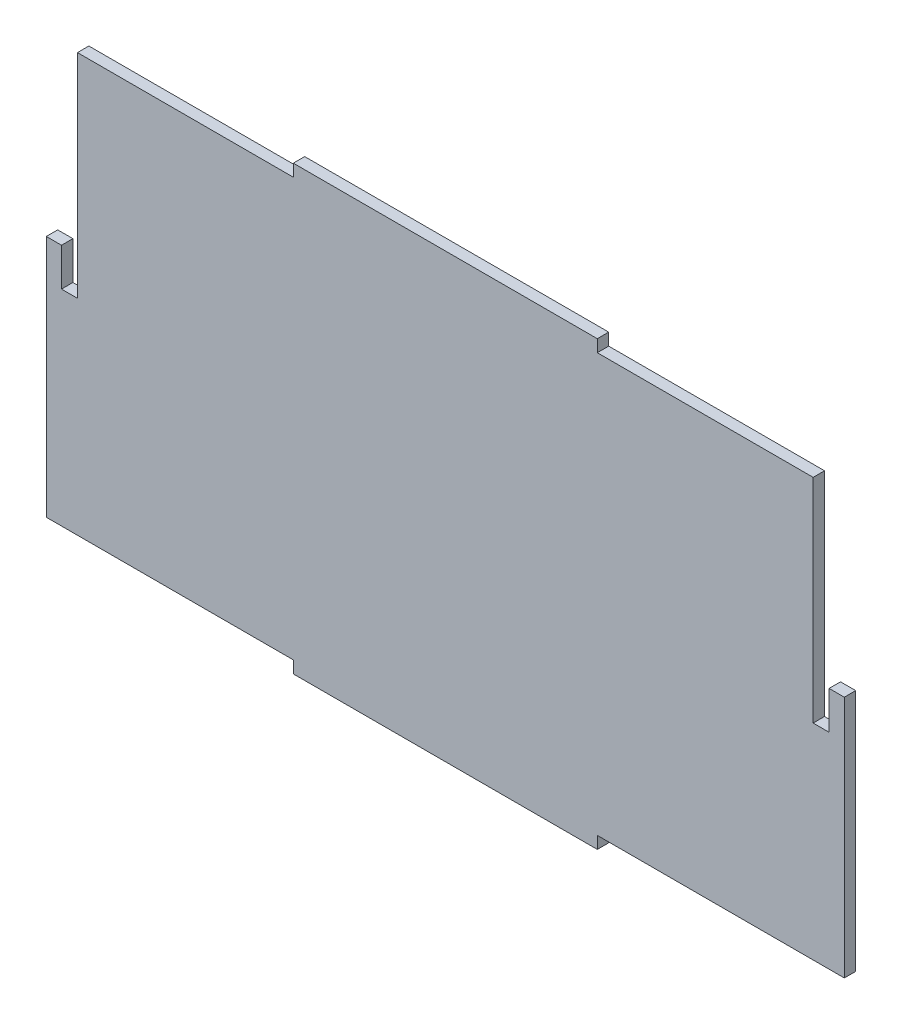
ISO-10303-21;
HEADER;
FILE_DESCRIPTION(('STEP AP214'),'2;1');
FILE_NAME('part.step','',(''),(''),'','','');
FILE_SCHEMA(('AUTOMOTIVE_DESIGN { 1 0 10303 214 1 1 1 1 }'));
ENDSEC;
DATA;
#1=APPLICATION_CONTEXT('core data for automotive mechanical design processes');
#2=APPLICATION_PROTOCOL_DEFINITION('international standard','automotive_design',2000,#1);
#3=PRODUCT_CONTEXT('',#1,'mechanical');
#4=PRODUCT('Part','Part','',(#3));
#5=PRODUCT_RELATED_PRODUCT_CATEGORY('part','',(#4));
#6=PRODUCT_DEFINITION_FORMATION('','',#4);
#7=PRODUCT_DEFINITION_CONTEXT('part definition',#1,'design');
#8=PRODUCT_DEFINITION('design','',#6,#7);
#9=PRODUCT_DEFINITION_SHAPE('','',#8);
#10=(LENGTH_UNIT() NAMED_UNIT(*) SI_UNIT(.MILLI.,.METRE.));
#11=(NAMED_UNIT(*) PLANE_ANGLE_UNIT() SI_UNIT($,.RADIAN.));
#12=(NAMED_UNIT(*) SI_UNIT($,.STERADIAN.) SOLID_ANGLE_UNIT());
#13=UNCERTAINTY_MEASURE_WITH_UNIT(LENGTH_MEASURE(1.E-05),#10,'distance_accuracy_value','');
#14=(GEOMETRIC_REPRESENTATION_CONTEXT(3) GLOBAL_UNCERTAINTY_ASSIGNED_CONTEXT((#13)) GLOBAL_UNIT_ASSIGNED_CONTEXT((#10,
#11,#12)) REPRESENTATION_CONTEXT('',''));
#15=CARTESIAN_POINT('',(0.,0.,0.));
#16=DIRECTION('',(0.,0.,1.));
#17=DIRECTION('',(1.,0.,0.));
#18=AXIS2_PLACEMENT_3D('',#15,#16,#17);
#19=CARTESIAN_POINT('',(-52.5,27.5,1.5));
#20=DIRECTION('',(1.,0.,0.));
#21=DIRECTION('',(0.,0.,-1.));
#22=AXIS2_PLACEMENT_3D('',#19,#20,#21);
#23=PLANE('',#22);
#24=DIRECTION('',(0.,-1.,0.));
#25=VECTOR('',#24,1.);
#26=CARTESIAN_POINT('',(-52.5,27.5,1.5));
#27=LINE('',#26,#25);
#28=CARTESIAN_POINT('',(-52.5,4.5,1.5));
#29=VERTEX_POINT('',#28);
#30=CARTESIAN_POINT('',(-52.5,-27.5,1.5));
#31=VERTEX_POINT('',#30);
#32=EDGE_CURVE('E184',#29,#31,#27,.T.);
#33=ORIENTED_EDGE('',*,*,#32,.F.);
#34=DIRECTION('',(0.,0.,1.));
#35=VECTOR('',#34,1.);
#36=CARTESIAN_POINT('',(-52.5,4.5,-8.5));
#37=LINE('',#36,#35);
#38=CARTESIAN_POINT('',(-52.5,4.5,0.));
#39=VERTEX_POINT('',#38);
#40=EDGE_CURVE('E172',#39,#29,#37,.T.);
#41=ORIENTED_EDGE('',*,*,#40,.F.);
#42=DIRECTION('',(0.,-1.,0.));
#43=VECTOR('',#42,1.);
#44=CARTESIAN_POINT('',(-52.5,27.5,0.));
#45=LINE('',#44,#43);
#46=CARTESIAN_POINT('',(-52.5,-27.5,0.));
#47=VERTEX_POINT('',#46);
#48=EDGE_CURVE('E256',#39,#47,#45,.T.);
#49=ORIENTED_EDGE('',*,*,#48,.T.);
#50=DIRECTION('',(0.,0.,-1.));
#51=VECTOR('',#50,1.);
#52=CARTESIAN_POINT('',(-52.5,-27.5,1.5));
#53=LINE('',#52,#51);
#54=EDGE_CURVE('E192',#31,#47,#53,.T.);
#55=ORIENTED_EDGE('',*,*,#54,.F.);
#56=EDGE_LOOP('',(#33,#41,#49,#55));
#57=FACE_BOUND('',#56,.T.);
#58=ADVANCED_FACE('F38',(#57),#23,.F.);
#59=CARTESIAN_POINT('',(-52.5,-27.5,1.5));
#60=DIRECTION('',(0.,1.,0.));
#61=DIRECTION('',(-1.,0.,0.));
#62=AXIS2_PLACEMENT_3D('',#59,#60,#61);
#63=PLANE('',#62);
#64=DIRECTION('',(1.,0.,0.));
#65=VECTOR('',#64,1.);
#66=CARTESIAN_POINT('',(-52.5,-27.5,0.));
#67=LINE('',#66,#65);
#68=CARTESIAN_POINT('',(-20.,-27.5,0.));
#69=VERTEX_POINT('',#68);
#70=EDGE_CURVE('E259',#47,#69,#67,.T.);
#71=ORIENTED_EDGE('',*,*,#70,.T.);
#72=DIRECTION('',(0.,0.,-1.));
#73=VECTOR('',#72,1.);
#74=CARTESIAN_POINT('',(-20.,-27.5,1.5));
#75=LINE('',#74,#73);
#76=CARTESIAN_POINT('',(-20.,-27.5,1.5));
#77=VERTEX_POINT('',#76);
#78=EDGE_CURVE('E362',#77,#69,#75,.T.);
#79=ORIENTED_EDGE('',*,*,#78,.F.);
#80=DIRECTION('',(1.,0.,0.));
#81=VECTOR('',#80,1.);
#82=CARTESIAN_POINT('',(-52.5,-27.5,1.5));
#83=LINE('',#82,#81);
#84=EDGE_CURVE('E194',#31,#77,#83,.T.);
#85=ORIENTED_EDGE('',*,*,#84,.F.);
#86=ORIENTED_EDGE('',*,*,#54,.T.);
#87=EDGE_LOOP('',(#71,#79,#85,#86));
#88=FACE_BOUND('',#87,.T.);
#89=ADVANCED_FACE('F400',(#88),#63,.F.);
#90=CARTESIAN_POINT('',(-20.,-27.5,1.5));
#91=DIRECTION('',(1.,0.,0.));
#92=DIRECTION('',(0.,0.,-1.));
#93=AXIS2_PLACEMENT_3D('',#90,#91,#92);
#94=PLANE('',#93);
#95=DIRECTION('',(0.,-1.,0.));
#96=VECTOR('',#95,1.);
#97=CARTESIAN_POINT('',(-20.,-27.5,0.));
#98=LINE('',#97,#96);
#99=CARTESIAN_POINT('',(-20.,-29.1,0.));
#100=VERTEX_POINT('',#99);
#101=EDGE_CURVE('E262',#69,#100,#98,.T.);
#102=ORIENTED_EDGE('',*,*,#101,.T.);
#103=DIRECTION('',(0.,0.,-1.));
#104=VECTOR('',#103,1.);
#105=CARTESIAN_POINT('',(-20.,-29.1,1.5));
#106=LINE('',#105,#104);
#107=CARTESIAN_POINT('',(-20.,-29.1,1.5));
#108=VERTEX_POINT('',#107);
#109=EDGE_CURVE('E358',#108,#100,#106,.T.);
#110=ORIENTED_EDGE('',*,*,#109,.F.);
#111=DIRECTION('',(0.,-1.,0.));
#112=VECTOR('',#111,1.);
#113=CARTESIAN_POINT('',(-20.,-27.5,1.5));
#114=LINE('',#113,#112);
#115=EDGE_CURVE('E199',#77,#108,#114,.T.);
#116=ORIENTED_EDGE('',*,*,#115,.F.);
#117=ORIENTED_EDGE('',*,*,#78,.T.);
#118=EDGE_LOOP('',(#102,#110,#116,#117));
#119=FACE_BOUND('',#118,.T.);
#120=ADVANCED_FACE('F396',(#119),#94,.F.);
#121=CARTESIAN_POINT('',(-20.,-29.1,1.5));
#122=DIRECTION('',(0.,1.,0.));
#123=DIRECTION('',(-1.,0.,0.));
#124=AXIS2_PLACEMENT_3D('',#121,#122,#123);
#125=PLANE('',#124);
#126=DIRECTION('',(1.,0.,0.));
#127=VECTOR('',#126,1.);
#128=CARTESIAN_POINT('',(-20.,-29.1,0.));
#129=LINE('',#128,#127);
#130=CARTESIAN_POINT('',(20.,-29.1,0.));
#131=VERTEX_POINT('',#130);
#132=EDGE_CURVE('E265',#100,#131,#129,.T.);
#133=ORIENTED_EDGE('',*,*,#132,.T.);
#134=DIRECTION('',(0.,0.,-1.));
#135=VECTOR('',#134,1.);
#136=CARTESIAN_POINT('',(20.,-29.1,1.5));
#137=LINE('',#136,#135);
#138=CARTESIAN_POINT('',(20.,-29.1,1.5));
#139=VERTEX_POINT('',#138);
#140=EDGE_CURVE('E354',#139,#131,#137,.T.);
#141=ORIENTED_EDGE('',*,*,#140,.F.);
#142=DIRECTION('',(1.,0.,0.));
#143=VECTOR('',#142,1.);
#144=CARTESIAN_POINT('',(-20.,-29.1,1.5));
#145=LINE('',#144,#143);
#146=EDGE_CURVE('E210',#108,#139,#145,.T.);
#147=ORIENTED_EDGE('',*,*,#146,.F.);
#148=ORIENTED_EDGE('',*,*,#109,.T.);
#149=EDGE_LOOP('',(#133,#141,#147,#148));
#150=FACE_BOUND('',#149,.T.);
#151=ADVANCED_FACE('F392',(#150),#125,.F.);
#152=CARTESIAN_POINT('',(20.,-27.5,1.5));
#153=DIRECTION('',(-1.,0.,0.));
#154=DIRECTION('',(0.,0.,1.));
#155=AXIS2_PLACEMENT_3D('',#152,#153,#154);
#156=PLANE('',#155);
#157=DIRECTION('',(0.,1.,0.));
#158=VECTOR('',#157,1.);
#159=CARTESIAN_POINT('',(20.,-27.5,0.));
#160=LINE('',#159,#158);
#161=CARTESIAN_POINT('',(20.,-27.5,0.));
#162=VERTEX_POINT('',#161);
#163=EDGE_CURVE('E268',#131,#162,#160,.T.);
#164=ORIENTED_EDGE('',*,*,#163,.T.);
#165=DIRECTION('',(0.,0.,-1.));
#166=VECTOR('',#165,1.);
#167=CARTESIAN_POINT('',(20.,-27.5,1.5));
#168=LINE('',#167,#166);
#169=CARTESIAN_POINT('',(20.,-27.5,1.5));
#170=VERTEX_POINT('',#169);
#171=EDGE_CURVE('E350',#170,#162,#168,.T.);
#172=ORIENTED_EDGE('',*,*,#171,.F.);
#173=DIRECTION('',(0.,1.,0.));
#174=VECTOR('',#173,1.);
#175=CARTESIAN_POINT('',(20.,-27.5,1.5));
#176=LINE('',#175,#174);
#177=EDGE_CURVE('E213',#139,#170,#176,.T.);
#178=ORIENTED_EDGE('',*,*,#177,.F.);
#179=ORIENTED_EDGE('',*,*,#140,.T.);
#180=EDGE_LOOP('',(#164,#172,#178,#179));
#181=FACE_BOUND('',#180,.T.);
#182=ADVANCED_FACE('F387',(#181),#156,.F.);
#183=CARTESIAN_POINT('',(20.,-27.5,1.5));
#184=DIRECTION('',(0.,1.,0.));
#185=DIRECTION('',(-1.,0.,0.));
#186=AXIS2_PLACEMENT_3D('',#183,#184,#185);
#187=PLANE('',#186);
#188=DIRECTION('',(1.,0.,0.));
#189=VECTOR('',#188,1.);
#190=CARTESIAN_POINT('',(20.,-27.5,0.));
#191=LINE('',#190,#189);
#192=CARTESIAN_POINT('',(52.5,-27.5,0.));
#193=VERTEX_POINT('',#192);
#194=EDGE_CURVE('E271',#162,#193,#191,.T.);
#195=ORIENTED_EDGE('',*,*,#194,.T.);
#196=DIRECTION('',(0.,0.,-1.));
#197=VECTOR('',#196,1.);
#198=CARTESIAN_POINT('',(52.5,-27.5,1.5));
#199=LINE('',#198,#197);
#200=CARTESIAN_POINT('',(52.5,-27.5,1.5));
#201=VERTEX_POINT('',#200);
#202=EDGE_CURVE('E346',#201,#193,#199,.T.);
#203=ORIENTED_EDGE('',*,*,#202,.F.);
#204=DIRECTION('',(1.,0.,0.));
#205=VECTOR('',#204,1.);
#206=CARTESIAN_POINT('',(20.,-27.5,1.5));
#207=LINE('',#206,#205);
#208=EDGE_CURVE('E216',#170,#201,#207,.T.);
#209=ORIENTED_EDGE('',*,*,#208,.F.);
#210=ORIENTED_EDGE('',*,*,#171,.T.);
#211=EDGE_LOOP('',(#195,#203,#209,#210));
#212=FACE_BOUND('',#211,.T.);
#213=ADVANCED_FACE('F381',(#212),#187,.F.);
#214=CARTESIAN_POINT('',(52.5,27.5,1.5));
#215=DIRECTION('',(-1.,0.,0.));
#216=DIRECTION('',(0.,-1.,0.));
#217=AXIS2_PLACEMENT_3D('',#214,#215,#216);
#218=PLANE('',#217);
#219=DIRECTION('',(0.,1.,0.));
#220=VECTOR('',#219,1.);
#221=CARTESIAN_POINT('',(52.5,27.5,0.));
#222=LINE('',#221,#220);
#223=CARTESIAN_POINT('',(52.5,4.5,0.));
#224=VERTEX_POINT('',#223);
#225=EDGE_CURVE('E274',#193,#224,#222,.T.);
#226=ORIENTED_EDGE('',*,*,#225,.T.);
#227=DIRECTION('',(0.,0.,1.));
#228=VECTOR('',#227,1.);
#229=CARTESIAN_POINT('',(52.5,4.5,-8.5));
#230=LINE('',#229,#228);
#231=CARTESIAN_POINT('',(52.5,4.5,1.5));
#232=VERTEX_POINT('',#231);
#233=EDGE_CURVE('E53',#224,#232,#230,.T.);
#234=ORIENTED_EDGE('',*,*,#233,.T.);
#235=DIRECTION('',(0.,1.,0.));
#236=VECTOR('',#235,1.);
#237=CARTESIAN_POINT('',(52.5,27.5,1.5));
#238=LINE('',#237,#236);
#239=EDGE_CURVE('E219',#201,#232,#238,.T.);
#240=ORIENTED_EDGE('',*,*,#239,.F.);
#241=ORIENTED_EDGE('',*,*,#202,.T.);
#242=EDGE_LOOP('',(#226,#234,#240,#241));
#243=FACE_BOUND('',#242,.T.);
#244=ADVANCED_FACE('F376',(#243),#218,.F.);
#245=CARTESIAN_POINT('',(50.5,27.5,1.5));
#246=DIRECTION('',(1.,0.,0.));
#247=DIRECTION('',(0.,0.,-1.));
#248=AXIS2_PLACEMENT_3D('',#245,#246,#247);
#249=PLANE('',#248);
#250=DIRECTION('',(0.,-1.,0.));
#251=VECTOR('',#250,1.);
#252=CARTESIAN_POINT('',(50.5,27.5,1.5));
#253=LINE('',#252,#251);
#254=CARTESIAN_POINT('',(50.5,4.5,1.5));
#255=VERTEX_POINT('',#254);
#256=CARTESIAN_POINT('',(50.5,-0.499999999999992,1.5));
#257=VERTEX_POINT('',#256);
#258=EDGE_CURVE('E223',#255,#257,#253,.T.);
#259=ORIENTED_EDGE('',*,*,#258,.F.);
#260=DIRECTION('',(0.,0.,1.));
#261=VECTOR('',#260,1.);
#262=CARTESIAN_POINT('',(50.5,4.5,-8.5));
#263=LINE('',#262,#261);
#264=CARTESIAN_POINT('',(50.5,4.5,0.));
#265=VERTEX_POINT('',#264);
#266=EDGE_CURVE('E205',#265,#255,#263,.T.);
#267=ORIENTED_EDGE('',*,*,#266,.F.);
#268=DIRECTION('',(0.,-1.,0.));
#269=VECTOR('',#268,1.);
#270=CARTESIAN_POINT('',(50.5,27.5,0.));
#271=LINE('',#270,#269);
#272=CARTESIAN_POINT('',(50.5,-0.499999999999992,0.));
#273=VERTEX_POINT('',#272);
#274=EDGE_CURVE('E278',#265,#273,#271,.T.);
#275=ORIENTED_EDGE('',*,*,#274,.T.);
#276=DIRECTION('',(0.,0.,-1.));
#277=VECTOR('',#276,1.);
#278=CARTESIAN_POINT('',(50.5,-0.499999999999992,1.5));
#279=LINE('',#278,#277);
#280=EDGE_CURVE('E342',#257,#273,#279,.T.);
#281=ORIENTED_EDGE('',*,*,#280,.F.);
#282=EDGE_LOOP('',(#259,#267,#275,#281));
#283=FACE_BOUND('',#282,.T.);
#284=ADVANCED_FACE('F408',(#283),#249,.F.);
#285=CARTESIAN_POINT('',(50.5,-0.499999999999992,1.5));
#286=DIRECTION('',(0.,-1.,0.));
#287=DIRECTION('',(1.,0.,0.));
#288=AXIS2_PLACEMENT_3D('',#285,#286,#287);
#289=PLANE('',#288);
#290=DIRECTION('',(-1.,0.,0.));
#291=VECTOR('',#290,1.);
#292=CARTESIAN_POINT('',(50.5,-0.499999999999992,0.));
#293=LINE('',#292,#291);
#294=CARTESIAN_POINT('',(48.4,-0.499999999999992,0.));
#295=VERTEX_POINT('',#294);
#296=EDGE_CURVE('E281',#273,#295,#293,.T.);
#297=ORIENTED_EDGE('',*,*,#296,.T.);
#298=DIRECTION('',(0.,0.,-1.));
#299=VECTOR('',#298,1.);
#300=CARTESIAN_POINT('',(48.4,-0.499999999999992,1.5));
#301=LINE('',#300,#299);
#302=CARTESIAN_POINT('',(48.4,-0.499999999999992,1.5));
#303=VERTEX_POINT('',#302);
#304=EDGE_CURVE('E338',#303,#295,#301,.T.);
#305=ORIENTED_EDGE('',*,*,#304,.F.);
#306=DIRECTION('',(-1.,0.,0.));
#307=VECTOR('',#306,1.);
#308=CARTESIAN_POINT('',(50.5,-0.499999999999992,1.5));
#309=LINE('',#308,#307);
#310=EDGE_CURVE('E226',#257,#303,#309,.T.);
#311=ORIENTED_EDGE('',*,*,#310,.F.);
#312=ORIENTED_EDGE('',*,*,#280,.T.);
#313=EDGE_LOOP('',(#297,#305,#311,#312));
#314=FACE_BOUND('',#313,.T.);
#315=ADVANCED_FACE('F412',(#314),#289,.F.);
#316=CARTESIAN_POINT('',(48.4,27.5,1.5));
#317=DIRECTION('',(-1.,0.,0.));
#318=DIRECTION('',(0.,-1.,0.));
#319=AXIS2_PLACEMENT_3D('',#316,#317,#318);
#320=PLANE('',#319);
#321=DIRECTION('',(0.,1.,0.));
#322=VECTOR('',#321,1.);
#323=CARTESIAN_POINT('',(48.4,27.5,0.));
#324=LINE('',#323,#322);
#325=CARTESIAN_POINT('',(48.4,27.5,0.));
#326=VERTEX_POINT('',#325);
#327=EDGE_CURVE('E284',#295,#326,#324,.T.);
#328=ORIENTED_EDGE('',*,*,#327,.T.);
#329=DIRECTION('',(0.,0.,-1.));
#330=VECTOR('',#329,1.);
#331=CARTESIAN_POINT('',(48.4,27.5,1.5));
#332=LINE('',#331,#330);
#333=CARTESIAN_POINT('',(48.4,27.5,1.5));
#334=VERTEX_POINT('',#333);
#335=EDGE_CURVE('E334',#334,#326,#332,.T.);
#336=ORIENTED_EDGE('',*,*,#335,.F.);
#337=DIRECTION('',(0.,1.,0.));
#338=VECTOR('',#337,1.);
#339=CARTESIAN_POINT('',(48.4,27.5,1.5));
#340=LINE('',#339,#338);
#341=EDGE_CURVE('E229',#303,#334,#340,.T.);
#342=ORIENTED_EDGE('',*,*,#341,.F.);
#343=ORIENTED_EDGE('',*,*,#304,.T.);
#344=EDGE_LOOP('',(#328,#336,#342,#343));
#345=FACE_BOUND('',#344,.T.);
#346=ADVANCED_FACE('F418',(#345),#320,.F.);
#347=CARTESIAN_POINT('',(20.,27.5,1.5));
#348=DIRECTION('',(0.,-1.,0.));
#349=DIRECTION('',(1.,0.,0.));
#350=AXIS2_PLACEMENT_3D('',#347,#348,#349);
#351=PLANE('',#350);
#352=DIRECTION('',(-1.,0.,0.));
#353=VECTOR('',#352,1.);
#354=CARTESIAN_POINT('',(20.,27.5,0.));
#355=LINE('',#354,#353);
#356=CARTESIAN_POINT('',(20.,27.5,0.));
#357=VERTEX_POINT('',#356);
#358=EDGE_CURVE('E287',#326,#357,#355,.T.);
#359=ORIENTED_EDGE('',*,*,#358,.T.);
#360=DIRECTION('',(0.,0.,-1.));
#361=VECTOR('',#360,1.);
#362=CARTESIAN_POINT('',(20.,27.5,1.5));
#363=LINE('',#362,#361);
#364=CARTESIAN_POINT('',(20.,27.5,1.5));
#365=VERTEX_POINT('',#364);
#366=EDGE_CURVE('E330',#365,#357,#363,.T.);
#367=ORIENTED_EDGE('',*,*,#366,.F.);
#368=DIRECTION('',(-1.,0.,0.));
#369=VECTOR('',#368,1.);
#370=CARTESIAN_POINT('',(20.,27.5,1.5));
#371=LINE('',#370,#369);
#372=EDGE_CURVE('E232',#334,#365,#371,.T.);
#373=ORIENTED_EDGE('',*,*,#372,.F.);
#374=ORIENTED_EDGE('',*,*,#335,.T.);
#375=EDGE_LOOP('',(#359,#367,#373,#374));
#376=FACE_BOUND('',#375,.T.);
#377=ADVANCED_FACE('F422',(#376),#351,.F.);
#378=CARTESIAN_POINT('',(20.,27.5,1.5));
#379=DIRECTION('',(-1.,0.,0.));
#380=DIRECTION('',(0.,0.,1.));
#381=AXIS2_PLACEMENT_3D('',#378,#379,#380);
#382=PLANE('',#381);
#383=DIRECTION('',(0.,1.,0.));
#384=VECTOR('',#383,1.);
#385=CARTESIAN_POINT('',(20.,27.5,0.));
#386=LINE('',#385,#384);
#387=CARTESIAN_POINT('',(20.,29.1,0.));
#388=VERTEX_POINT('',#387);
#389=EDGE_CURVE('E290',#357,#388,#386,.T.);
#390=ORIENTED_EDGE('',*,*,#389,.T.);
#391=DIRECTION('',(0.,0.,-1.));
#392=VECTOR('',#391,1.);
#393=CARTESIAN_POINT('',(20.,29.1,1.5));
#394=LINE('',#393,#392);
#395=CARTESIAN_POINT('',(20.,29.1,1.5));
#396=VERTEX_POINT('',#395);
#397=EDGE_CURVE('E326',#396,#388,#394,.T.);
#398=ORIENTED_EDGE('',*,*,#397,.F.);
#399=DIRECTION('',(0.,1.,0.));
#400=VECTOR('',#399,1.);
#401=CARTESIAN_POINT('',(20.,27.5,1.5));
#402=LINE('',#401,#400);
#403=EDGE_CURVE('E235',#365,#396,#402,.T.);
#404=ORIENTED_EDGE('',*,*,#403,.F.);
#405=ORIENTED_EDGE('',*,*,#366,.T.);
#406=EDGE_LOOP('',(#390,#398,#404,#405));
#407=FACE_BOUND('',#406,.T.);
#408=ADVANCED_FACE('F427',(#407),#382,.F.);
#409=CARTESIAN_POINT('',(-20.,29.1,1.5));
#410=DIRECTION('',(0.,-1.,0.));
#411=DIRECTION('',(1.,0.,0.));
#412=AXIS2_PLACEMENT_3D('',#409,#410,#411);
#413=PLANE('',#412);
#414=DIRECTION('',(-1.,0.,0.));
#415=VECTOR('',#414,1.);
#416=CARTESIAN_POINT('',(-20.,29.1,0.));
#417=LINE('',#416,#415);
#418=CARTESIAN_POINT('',(-20.,29.1,0.));
#419=VERTEX_POINT('',#418);
#420=EDGE_CURVE('E293',#388,#419,#417,.T.);
#421=ORIENTED_EDGE('',*,*,#420,.T.);
#422=DIRECTION('',(0.,0.,-1.));
#423=VECTOR('',#422,1.);
#424=CARTESIAN_POINT('',(-20.,29.1,1.5));
#425=LINE('',#424,#423);
#426=CARTESIAN_POINT('',(-20.,29.1,1.5));
#427=VERTEX_POINT('',#426);
#428=EDGE_CURVE('E322',#427,#419,#425,.T.);
#429=ORIENTED_EDGE('',*,*,#428,.F.);
#430=DIRECTION('',(-1.,0.,0.));
#431=VECTOR('',#430,1.);
#432=CARTESIAN_POINT('',(-20.,29.1,1.5));
#433=LINE('',#432,#431);
#434=EDGE_CURVE('E238',#396,#427,#433,.T.);
#435=ORIENTED_EDGE('',*,*,#434,.F.);
#436=ORIENTED_EDGE('',*,*,#397,.T.);
#437=EDGE_LOOP('',(#421,#429,#435,#436));
#438=FACE_BOUND('',#437,.T.);
#439=ADVANCED_FACE('F433',(#438),#413,.F.);
#440=CARTESIAN_POINT('',(-20.,27.5,1.5));
#441=DIRECTION('',(1.,0.,0.));
#442=DIRECTION('',(0.,0.,-1.));
#443=AXIS2_PLACEMENT_3D('',#440,#441,#442);
#444=PLANE('',#443);
#445=DIRECTION('',(0.,-1.,0.));
#446=VECTOR('',#445,1.);
#447=CARTESIAN_POINT('',(-20.,27.5,0.));
#448=LINE('',#447,#446);
#449=CARTESIAN_POINT('',(-20.,27.5,0.));
#450=VERTEX_POINT('',#449);
#451=EDGE_CURVE('E296',#419,#450,#448,.T.);
#452=ORIENTED_EDGE('',*,*,#451,.T.);
#453=DIRECTION('',(0.,0.,-1.));
#454=VECTOR('',#453,1.);
#455=CARTESIAN_POINT('',(-20.,27.5,1.5));
#456=LINE('',#455,#454);
#457=CARTESIAN_POINT('',(-20.,27.5,1.5));
#458=VERTEX_POINT('',#457);
#459=EDGE_CURVE('E318',#458,#450,#456,.T.);
#460=ORIENTED_EDGE('',*,*,#459,.F.);
#461=DIRECTION('',(0.,-1.,0.));
#462=VECTOR('',#461,1.);
#463=CARTESIAN_POINT('',(-20.,27.5,1.5));
#464=LINE('',#463,#462);
#465=EDGE_CURVE('E241',#427,#458,#464,.T.);
#466=ORIENTED_EDGE('',*,*,#465,.F.);
#467=ORIENTED_EDGE('',*,*,#428,.T.);
#468=EDGE_LOOP('',(#452,#460,#466,#467));
#469=FACE_BOUND('',#468,.T.);
#470=ADVANCED_FACE('F437',(#469),#444,.F.);
#471=CARTESIAN_POINT('',(-48.4,27.5,1.5));
#472=DIRECTION('',(0.,-1.,0.));
#473=DIRECTION('',(1.,0.,0.));
#474=AXIS2_PLACEMENT_3D('',#471,#472,#473);
#475=PLANE('',#474);
#476=DIRECTION('',(-1.,0.,0.));
#477=VECTOR('',#476,1.);
#478=CARTESIAN_POINT('',(-48.4,27.5,0.));
#479=LINE('',#478,#477);
#480=CARTESIAN_POINT('',(-48.4,27.5,0.));
#481=VERTEX_POINT('',#480);
#482=EDGE_CURVE('E299',#450,#481,#479,.T.);
#483=ORIENTED_EDGE('',*,*,#482,.T.);
#484=DIRECTION('',(0.,0.,-1.));
#485=VECTOR('',#484,1.);
#486=CARTESIAN_POINT('',(-48.4,27.5,1.5));
#487=LINE('',#486,#485);
#488=CARTESIAN_POINT('',(-48.4,27.5,1.5));
#489=VERTEX_POINT('',#488);
#490=EDGE_CURVE('E314',#489,#481,#487,.T.);
#491=ORIENTED_EDGE('',*,*,#490,.F.);
#492=DIRECTION('',(-1.,0.,0.));
#493=VECTOR('',#492,1.);
#494=CARTESIAN_POINT('',(-48.4,27.5,1.5));
#495=LINE('',#494,#493);
#496=EDGE_CURVE('E244',#458,#489,#495,.T.);
#497=ORIENTED_EDGE('',*,*,#496,.F.);
#498=ORIENTED_EDGE('',*,*,#459,.T.);
#499=EDGE_LOOP('',(#483,#491,#497,#498));
#500=FACE_BOUND('',#499,.T.);
#501=ADVANCED_FACE('F442',(#500),#475,.F.);
#502=CARTESIAN_POINT('',(-48.4,27.5,1.5));
#503=DIRECTION('',(1.,0.,0.));
#504=DIRECTION('',(0.,1.,0.));
#505=AXIS2_PLACEMENT_3D('',#502,#503,#504);
#506=PLANE('',#505);
#507=DIRECTION('',(0.,-1.,0.));
#508=VECTOR('',#507,1.);
#509=CARTESIAN_POINT('',(-48.4,27.5,0.));
#510=LINE('',#509,#508);
#511=CARTESIAN_POINT('',(-48.4,-0.500000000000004,0.));
#512=VERTEX_POINT('',#511);
#513=EDGE_CURVE('E302',#481,#512,#510,.T.);
#514=ORIENTED_EDGE('',*,*,#513,.T.);
#515=DIRECTION('',(0.,0.,-1.));
#516=VECTOR('',#515,1.);
#517=CARTESIAN_POINT('',(-48.4,-0.500000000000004,1.5));
#518=LINE('',#517,#516);
#519=CARTESIAN_POINT('',(-48.4,-0.500000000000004,1.5));
#520=VERTEX_POINT('',#519);
#521=EDGE_CURVE('E310',#520,#512,#518,.T.);
#522=ORIENTED_EDGE('',*,*,#521,.F.);
#523=DIRECTION('',(0.,-1.,0.));
#524=VECTOR('',#523,1.);
#525=CARTESIAN_POINT('',(-48.4,27.5,1.5));
#526=LINE('',#525,#524);
#527=EDGE_CURVE('E247',#489,#520,#526,.T.);
#528=ORIENTED_EDGE('',*,*,#527,.F.);
#529=ORIENTED_EDGE('',*,*,#490,.T.);
#530=EDGE_LOOP('',(#514,#522,#528,#529));
#531=FACE_BOUND('',#530,.T.);
#532=ADVANCED_FACE('F448',(#531),#506,.F.);
#533=CARTESIAN_POINT('',(-50.5,-0.500000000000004,1.5));
#534=DIRECTION('',(0.,-1.,0.));
#535=DIRECTION('',(1.,0.,0.));
#536=AXIS2_PLACEMENT_3D('',#533,#534,#535);
#537=PLANE('',#536);
#538=DIRECTION('',(-1.,0.,0.));
#539=VECTOR('',#538,1.);
#540=CARTESIAN_POINT('',(-50.5,-0.500000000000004,0.));
#541=LINE('',#540,#539);
#542=CARTESIAN_POINT('',(-50.5,-0.500000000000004,0.));
#543=VERTEX_POINT('',#542);
#544=EDGE_CURVE('E202',#512,#543,#541,.T.);
#545=ORIENTED_EDGE('',*,*,#544,.T.);
#546=DIRECTION('',(0.,0.,-1.));
#547=VECTOR('',#546,1.);
#548=CARTESIAN_POINT('',(-50.5,-0.500000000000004,1.5));
#549=LINE('',#548,#547);
#550=CARTESIAN_POINT('',(-50.5,-0.500000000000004,1.5));
#551=VERTEX_POINT('',#550);
#552=EDGE_CURVE('E255',#551,#543,#549,.T.);
#553=ORIENTED_EDGE('',*,*,#552,.F.);
#554=DIRECTION('',(-1.,0.,0.));
#555=VECTOR('',#554,1.);
#556=CARTESIAN_POINT('',(-50.5,-0.500000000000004,1.5));
#557=LINE('',#556,#555);
#558=EDGE_CURVE('E250',#520,#551,#557,.T.);
#559=ORIENTED_EDGE('',*,*,#558,.F.);
#560=ORIENTED_EDGE('',*,*,#521,.T.);
#561=EDGE_LOOP('',(#545,#553,#559,#560));
#562=FACE_BOUND('',#561,.T.);
#563=ADVANCED_FACE('F452',(#562),#537,.F.);
#564=CARTESIAN_POINT('',(-50.5,27.5,1.5));
#565=DIRECTION('',(-1.,0.,0.));
#566=DIRECTION('',(0.,0.,1.));
#567=AXIS2_PLACEMENT_3D('',#564,#565,#566);
#568=PLANE('',#567);
#569=DIRECTION('',(0.,1.,0.));
#570=VECTOR('',#569,1.);
#571=CARTESIAN_POINT('',(-50.5,27.5,0.));
#572=LINE('',#571,#570);
#573=CARTESIAN_POINT('',(-50.5,4.5,0.));
#574=VERTEX_POINT('',#573);
#575=EDGE_CURVE('E195',#543,#574,#572,.T.);
#576=ORIENTED_EDGE('',*,*,#575,.T.);
#577=DIRECTION('',(0.,0.,1.));
#578=VECTOR('',#577,1.);
#579=CARTESIAN_POINT('',(-50.5,4.5,-8.5));
#580=LINE('',#579,#578);
#581=CARTESIAN_POINT('',(-50.5,4.5,1.5));
#582=VERTEX_POINT('',#581);
#583=EDGE_CURVE('E61',#574,#582,#580,.T.);
#584=ORIENTED_EDGE('',*,*,#583,.T.);
#585=DIRECTION('',(0.,1.,0.));
#586=VECTOR('',#585,1.);
#587=CARTESIAN_POINT('',(-50.5,27.5,1.5));
#588=LINE('',#587,#586);
#589=EDGE_CURVE('E187',#551,#582,#588,.T.);
#590=ORIENTED_EDGE('',*,*,#589,.F.);
#591=ORIENTED_EDGE('',*,*,#552,.T.);
#592=EDGE_LOOP('',(#576,#584,#590,#591));
#593=FACE_BOUND('',#592,.T.);
#594=ADVANCED_FACE('F455',(#593),#568,.F.);
#595=CARTESIAN_POINT('',(0.,0.,1.5));
#596=DIRECTION('',(0.,0.,1.));
#597=DIRECTION('',(1.,0.,0.));
#598=AXIS2_PLACEMENT_3D('',#595,#596,#597);
#599=PLANE('',#598);
#600=DIRECTION('',(1.,0.,0.));
#601=VECTOR('',#600,1.);
#602=CARTESIAN_POINT('',(-52.5,4.5,1.5));
#603=LINE('',#602,#601);
#604=EDGE_CURVE('E175',#29,#582,#603,.T.);
#605=ORIENTED_EDGE('',*,*,#604,.F.);
#606=ORIENTED_EDGE('',*,*,#32,.T.);
#607=ORIENTED_EDGE('',*,*,#84,.T.);
#608=ORIENTED_EDGE('',*,*,#115,.T.);
#609=ORIENTED_EDGE('',*,*,#146,.T.);
#610=ORIENTED_EDGE('',*,*,#177,.T.);
#611=ORIENTED_EDGE('',*,*,#208,.T.);
#612=ORIENTED_EDGE('',*,*,#239,.T.);
#613=DIRECTION('',(1.,0.,0.));
#614=VECTOR('',#613,1.);
#615=CARTESIAN_POINT('',(52.5,4.5,1.5));
#616=LINE('',#615,#614);
#617=EDGE_CURVE('E402',#255,#232,#616,.T.);
#618=ORIENTED_EDGE('',*,*,#617,.F.);
#619=ORIENTED_EDGE('',*,*,#258,.T.);
#620=ORIENTED_EDGE('',*,*,#310,.T.);
#621=ORIENTED_EDGE('',*,*,#341,.T.);
#622=ORIENTED_EDGE('',*,*,#372,.T.);
#623=ORIENTED_EDGE('',*,*,#403,.T.);
#624=ORIENTED_EDGE('',*,*,#434,.T.);
#625=ORIENTED_EDGE('',*,*,#465,.T.);
#626=ORIENTED_EDGE('',*,*,#496,.T.);
#627=ORIENTED_EDGE('',*,*,#527,.T.);
#628=ORIENTED_EDGE('',*,*,#558,.T.);
#629=ORIENTED_EDGE('',*,*,#589,.T.);
#630=EDGE_LOOP('',(#605,#606,#607,#608,#609,#610,#611,#612,#618,#619,#620,#621,#622,#623,#624,
#625,#626,#627,#628,#629));
#631=FACE_BOUND('',#630,.T.);
#632=ADVANCED_FACE('F183',(#631),#599,.T.);
#633=CARTESIAN_POINT('',(0.,0.,0.));
#634=DIRECTION('',(0.,0.,1.));
#635=DIRECTION('',(1.,0.,0.));
#636=AXIS2_PLACEMENT_3D('',#633,#634,#635);
#637=PLANE('',#636);
#638=ORIENTED_EDGE('',*,*,#48,.F.);
#639=DIRECTION('',(1.,0.,0.));
#640=VECTOR('',#639,1.);
#641=CARTESIAN_POINT('',(0.,4.49999999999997,0.));
#642=LINE('',#641,#640);
#643=EDGE_CURVE('E11',#39,#574,#642,.T.);
#644=ORIENTED_EDGE('',*,*,#643,.T.);
#645=ORIENTED_EDGE('',*,*,#575,.F.);
#646=ORIENTED_EDGE('',*,*,#544,.F.);
#647=ORIENTED_EDGE('',*,*,#513,.F.);
#648=ORIENTED_EDGE('',*,*,#482,.F.);
#649=ORIENTED_EDGE('',*,*,#451,.F.);
#650=ORIENTED_EDGE('',*,*,#420,.F.);
#651=ORIENTED_EDGE('',*,*,#389,.F.);
#652=ORIENTED_EDGE('',*,*,#358,.F.);
#653=ORIENTED_EDGE('',*,*,#327,.F.);
#654=ORIENTED_EDGE('',*,*,#296,.F.);
#655=ORIENTED_EDGE('',*,*,#274,.F.);
#656=DIRECTION('',(1.,0.,0.));
#657=VECTOR('',#656,1.);
#658=CARTESIAN_POINT('',(0.,4.49999999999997,0.));
#659=LINE('',#658,#657);
#660=EDGE_CURVE('E46',#265,#224,#659,.T.);
#661=ORIENTED_EDGE('',*,*,#660,.T.);
#662=ORIENTED_EDGE('',*,*,#225,.F.);
#663=ORIENTED_EDGE('',*,*,#194,.F.);
#664=ORIENTED_EDGE('',*,*,#163,.F.);
#665=ORIENTED_EDGE('',*,*,#132,.F.);
#666=ORIENTED_EDGE('',*,*,#101,.F.);
#667=ORIENTED_EDGE('',*,*,#70,.F.);
#668=EDGE_LOOP('',(#638,#644,#645,#646,#647,#648,#649,#650,#651,#652,#653,#654,#655,#661,#662,
#663,#664,#665,#666,#667));
#669=FACE_BOUND('',#668,.T.);
#670=ADVANCED_FACE('F371',(#669),#637,.F.);
#671=CARTESIAN_POINT('',(52.5,4.5,-8.5));
#672=DIRECTION('',(0.,-1.,0.));
#673=DIRECTION('',(1.,0.,0.));
#674=AXIS2_PLACEMENT_3D('',#671,#672,#673);
#675=PLANE('',#674);
#676=ORIENTED_EDGE('',*,*,#266,.T.);
#677=ORIENTED_EDGE('',*,*,#617,.T.);
#678=ORIENTED_EDGE('',*,*,#233,.F.);
#679=ORIENTED_EDGE('',*,*,#660,.F.);
#680=EDGE_LOOP('',(#676,#677,#678,#679));
#681=FACE_BOUND('',#680,.T.);
#682=ADVANCED_FACE('F460',(#681),#675,.F.);
#683=CARTESIAN_POINT('',(-52.5,4.5,-8.5));
#684=DIRECTION('',(0.,-1.,0.));
#685=DIRECTION('',(1.,0.,0.));
#686=AXIS2_PLACEMENT_3D('',#683,#684,#685);
#687=PLANE('',#686);
#688=ORIENTED_EDGE('',*,*,#40,.T.);
#689=ORIENTED_EDGE('',*,*,#604,.T.);
#690=ORIENTED_EDGE('',*,*,#583,.F.);
#691=ORIENTED_EDGE('',*,*,#643,.F.);
#692=EDGE_LOOP('',(#688,#689,#690,#691));
#693=FACE_BOUND('',#692,.T.);
#694=ADVANCED_FACE('F174',(#693),#687,.F.);
#695=CLOSED_SHELL('',(#58,#89,#120,#151,#182,#213,#244,#284,#315,#346,#377,#408,#439,#470,#501,
#532,#563,#594,#632,#670,#682,#694));
#696=MANIFOLD_SOLID_BREP('B2',#695);
#697=ADVANCED_BREP_SHAPE_REPRESENTATION('',(#18,#696),#14);
#698=SHAPE_DEFINITION_REPRESENTATION(#9,#697);
ENDSEC;
END-ISO-10303-21;
